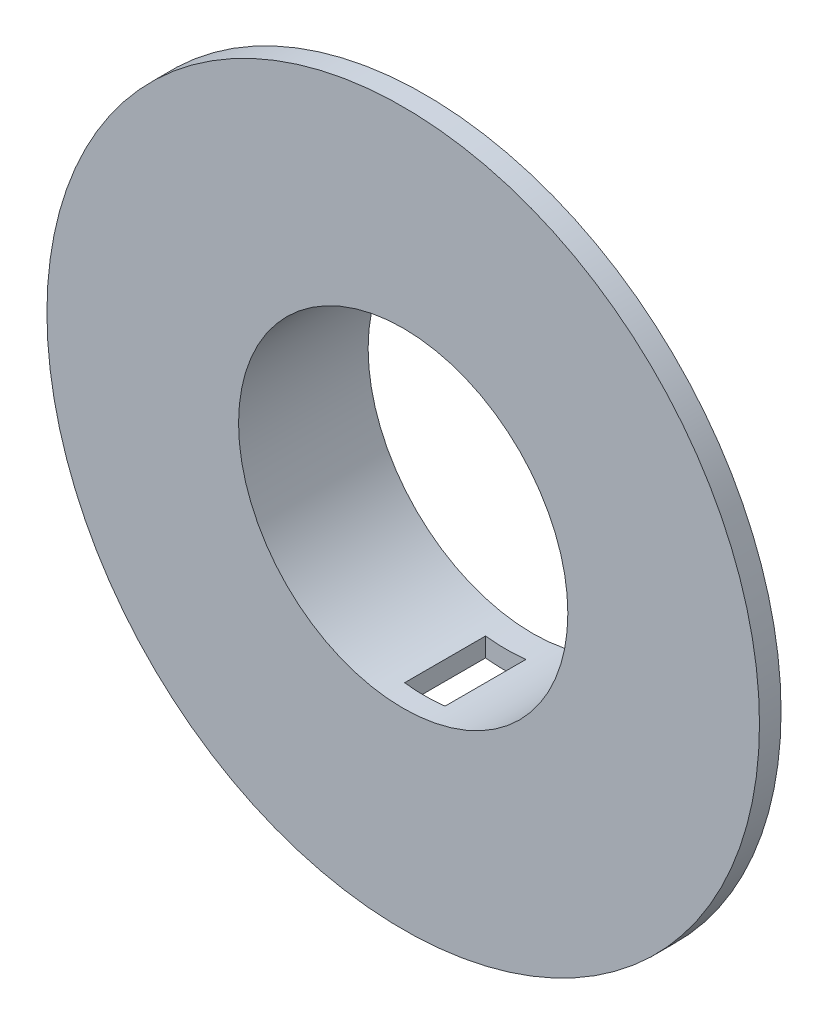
ISO-10303-21;
HEADER;
FILE_DESCRIPTION(('STEP AP214'),'2;1');
FILE_NAME('part.step','',(''),(''),'','','');
FILE_SCHEMA(('AUTOMOTIVE_DESIGN { 1 0 10303 214 1 1 1 1 }'));
ENDSEC;
DATA;
#1=APPLICATION_CONTEXT('core data for automotive mechanical design processes');
#2=APPLICATION_PROTOCOL_DEFINITION('international standard','automotive_design',2000,#1);
#3=PRODUCT_CONTEXT('',#1,'mechanical');
#4=PRODUCT('Part','Part','',(#3));
#5=PRODUCT_RELATED_PRODUCT_CATEGORY('part','',(#4));
#6=PRODUCT_DEFINITION_FORMATION('','',#4);
#7=PRODUCT_DEFINITION_CONTEXT('part definition',#1,'design');
#8=PRODUCT_DEFINITION('design','',#6,#7);
#9=PRODUCT_DEFINITION_SHAPE('','',#8);
#10=(LENGTH_UNIT() NAMED_UNIT(*) SI_UNIT(.MILLI.,.METRE.));
#11=(NAMED_UNIT(*) PLANE_ANGLE_UNIT() SI_UNIT($,.RADIAN.));
#12=(NAMED_UNIT(*) SI_UNIT($,.STERADIAN.) SOLID_ANGLE_UNIT());
#13=UNCERTAINTY_MEASURE_WITH_UNIT(LENGTH_MEASURE(1.E-05),#10,'distance_accuracy_value','');
#14=(GEOMETRIC_REPRESENTATION_CONTEXT(3) GLOBAL_UNCERTAINTY_ASSIGNED_CONTEXT((#13)) GLOBAL_UNIT_ASSIGNED_CONTEXT((#10,
#11,#12)) REPRESENTATION_CONTEXT('',''));
#15=CARTESIAN_POINT('',(0.,0.,0.));
#16=DIRECTION('',(0.,0.,1.));
#17=DIRECTION('',(1.,0.,0.));
#18=AXIS2_PLACEMENT_3D('',#15,#16,#17);
#19=CARTESIAN_POINT('',(0.,0.,4.));
#20=DIRECTION('',(0.,0.,-1.));
#21=DIRECTION('',(-1.,0.,0.));
#22=AXIS2_PLACEMENT_3D('',#19,#20,#21);
#23=CYLINDRICAL_SURFACE('',#22,66.);
#24=CARTESIAN_POINT('',(0.,0.,4.));
#25=DIRECTION('',(0.,0.,1.));
#26=DIRECTION('',(1.,0.,0.));
#27=AXIS2_PLACEMENT_3D('',#24,#25,#26);
#28=CIRCLE('',#27,66.);
#29=CARTESIAN_POINT('',(66.,0.,4.));
#30=VERTEX_POINT('',#29);
#31=EDGE_CURVE('E140',#30,#30,#28,.T.);
#32=ORIENTED_EDGE('',*,*,#31,.F.);
#33=EDGE_LOOP('',(#32));
#34=FACE_BOUND('',#33,.T.);
#35=CARTESIAN_POINT('',(0.,0.,0.));
#36=DIRECTION('',(0.,0.,1.));
#37=DIRECTION('',(1.,0.,0.));
#38=AXIS2_PLACEMENT_3D('',#35,#36,#37);
#39=CIRCLE('',#38,66.);
#40=CARTESIAN_POINT('',(66.,0.,0.));
#41=VERTEX_POINT('',#40);
#42=EDGE_CURVE('E146',#41,#41,#39,.T.);
#43=ORIENTED_EDGE('',*,*,#42,.T.);
#44=EDGE_LOOP('',(#43));
#45=FACE_BOUND('',#44,.T.);
#46=ADVANCED_FACE('F44',(#34,#45),#23,.T.);
#47=CARTESIAN_POINT('',(0.,0.,4.));
#48=DIRECTION('',(0.,0.,1.));
#49=DIRECTION('',(1.,0.,0.));
#50=AXIS2_PLACEMENT_3D('',#47,#48,#49);
#51=PLANE('',#50);
#52=CARTESIAN_POINT('',(0.,0.,4.));
#53=DIRECTION('',(0.,0.,1.));
#54=DIRECTION('',(1.,0.,0.));
#55=AXIS2_PLACEMENT_3D('',#52,#53,#54);
#56=CIRCLE('',#55,30.5);
#57=CARTESIAN_POINT('',(30.5,0.,4.));
#58=VERTEX_POINT('',#57);
#59=EDGE_CURVE('E143',#58,#58,#56,.T.);
#60=ORIENTED_EDGE('',*,*,#59,.F.);
#61=EDGE_LOOP('',(#60));
#62=FACE_BOUND('',#61,.T.);
#63=ORIENTED_EDGE('',*,*,#31,.T.);
#64=EDGE_LOOP('',(#63));
#65=FACE_BOUND('',#64,.T.);
#66=ADVANCED_FACE('F236',(#62,#65),#51,.T.);
#67=CARTESIAN_POINT('',(0.,0.,0.));
#68=DIRECTION('',(0.,0.,1.));
#69=DIRECTION('',(1.,0.,0.));
#70=AXIS2_PLACEMENT_3D('',#67,#68,#69);
#71=PLANE('',#70);
#72=CARTESIAN_POINT('',(0.,0.,0.));
#73=DIRECTION('',(0.,0.,-1.));
#74=DIRECTION('',(-1.,0.,0.));
#75=AXIS2_PLACEMENT_3D('',#72,#73,#74);
#76=CIRCLE('',#75,34.);
#77=CARTESIAN_POINT('',(-3.75,-33.7925657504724,0.));
#78=VERTEX_POINT('',#77);
#79=CARTESIAN_POINT('',(-3.75,33.7925657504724,0.));
#80=VERTEX_POINT('',#79);
#81=EDGE_CURVE('E137',#78,#80,#76,.T.);
#82=ORIENTED_EDGE('',*,*,#81,.F.);
#83=DIRECTION('',(0.,1.,0.));
#84=VECTOR('',#83,1.);
#85=CARTESIAN_POINT('',(-3.75,-66.,0.));
#86=LINE('',#85,#84);
#87=CARTESIAN_POINT('',(-3.75,-30.2685893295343,0.));
#88=VERTEX_POINT('',#87);
#89=EDGE_CURVE('E58',#78,#88,#86,.T.);
#90=ORIENTED_EDGE('',*,*,#89,.T.);
#91=CARTESIAN_POINT('',(0.,0.,0.));
#92=DIRECTION('',(0.,0.,1.));
#93=DIRECTION('',(1.,0.,0.));
#94=AXIS2_PLACEMENT_3D('',#91,#92,#93);
#95=CIRCLE('',#94,30.5);
#96=CARTESIAN_POINT('',(3.75,-30.2685893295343,0.));
#97=VERTEX_POINT('',#96);
#98=EDGE_CURVE('E130',#97,#88,#95,.F.);
#99=ORIENTED_EDGE('',*,*,#98,.F.);
#100=DIRECTION('',(0.,1.,0.));
#101=VECTOR('',#100,1.);
#102=CARTESIAN_POINT('',(3.75,-66.,0.));
#103=LINE('',#102,#101);
#104=CARTESIAN_POINT('',(3.75,-33.7925657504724,0.));
#105=VERTEX_POINT('',#104);
#106=EDGE_CURVE('E115',#105,#97,#103,.T.);
#107=ORIENTED_EDGE('',*,*,#106,.F.);
#108=CARTESIAN_POINT('',(3.75,33.7925657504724,0.));
#109=VERTEX_POINT('',#108);
#110=EDGE_CURVE('E125',#109,#105,#76,.T.);
#111=ORIENTED_EDGE('',*,*,#110,.F.);
#112=CARTESIAN_POINT('',(3.75,30.2685893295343,0.));
#113=VERTEX_POINT('',#112);
#114=EDGE_CURVE('E67',#113,#109,#103,.T.);
#115=ORIENTED_EDGE('',*,*,#114,.F.);
#116=CARTESIAN_POINT('',(-3.75,30.2685893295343,0.));
#117=VERTEX_POINT('',#116);
#118=EDGE_CURVE('E182',#117,#113,#95,.F.);
#119=ORIENTED_EDGE('',*,*,#118,.F.);
#120=EDGE_CURVE('E189',#117,#80,#86,.T.);
#121=ORIENTED_EDGE('',*,*,#120,.T.);
#122=EDGE_LOOP('',(#82,#90,#99,#107,#111,#115,#119,#121));
#123=FACE_BOUND('',#122,.T.);
#124=ORIENTED_EDGE('',*,*,#42,.F.);
#125=EDGE_LOOP('',(#124));
#126=FACE_BOUND('',#125,.T.);
#127=ADVANCED_FACE('F121',(#123,#126),#71,.F.);
#128=CARTESIAN_POINT('',(0.,0.,-26.));
#129=DIRECTION('',(0.,0.,1.));
#130=DIRECTION('',(1.,0.,0.));
#131=AXIS2_PLACEMENT_3D('',#128,#129,#130);
#132=CYLINDRICAL_SURFACE('',#131,30.5);
#133=ORIENTED_EDGE('',*,*,#98,.T.);
#134=DIRECTION('',(0.,0.,1.));
#135=VECTOR('',#134,1.);
#136=CARTESIAN_POINT('',(-3.75,-30.2685893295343,-26.));
#137=LINE('',#136,#135);
#138=CARTESIAN_POINT('',(-3.75,-30.2685893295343,-15.));
#139=VERTEX_POINT('',#138);
#140=EDGE_CURVE('E210',#88,#139,#137,.F.);
#141=ORIENTED_EDGE('',*,*,#140,.T.);
#142=CARTESIAN_POINT('',(0.,0.,-15.));
#143=DIRECTION('',(0.,0.,-1.));
#144=DIRECTION('',(-1.,0.,0.));
#145=AXIS2_PLACEMENT_3D('',#142,#143,#144);
#146=CIRCLE('',#145,30.5);
#147=CARTESIAN_POINT('',(3.75,-30.2685893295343,-15.));
#148=VERTEX_POINT('',#147);
#149=EDGE_CURVE('E203',#139,#148,#146,.F.);
#150=ORIENTED_EDGE('',*,*,#149,.T.);
#151=DIRECTION('',(0.,0.,1.));
#152=VECTOR('',#151,1.);
#153=CARTESIAN_POINT('',(3.75,-30.2685893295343,-26.));
#154=LINE('',#153,#152);
#155=EDGE_CURVE('E191',#148,#97,#154,.T.);
#156=ORIENTED_EDGE('',*,*,#155,.T.);
#157=EDGE_LOOP('',(#133,#141,#150,#156));
#158=FACE_BOUND('',#157,.T.);
#159=CARTESIAN_POINT('',(3.75,30.2685893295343,-15.));
#160=VERTEX_POINT('',#159);
#161=CARTESIAN_POINT('',(-3.75,30.2685893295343,-15.));
#162=VERTEX_POINT('',#161);
#163=EDGE_CURVE('E201',#160,#162,#146,.F.);
#164=ORIENTED_EDGE('',*,*,#163,.T.);
#165=DIRECTION('',(0.,0.,1.));
#166=VECTOR('',#165,1.);
#167=CARTESIAN_POINT('',(-3.75,30.2685893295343,-26.));
#168=LINE('',#167,#166);
#169=EDGE_CURVE('E176',#162,#117,#168,.T.);
#170=ORIENTED_EDGE('',*,*,#169,.T.);
#171=ORIENTED_EDGE('',*,*,#118,.T.);
#172=DIRECTION('',(0.,0.,1.));
#173=VECTOR('',#172,1.);
#174=CARTESIAN_POINT('',(3.75,30.2685893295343,-26.));
#175=LINE('',#174,#173);
#176=EDGE_CURVE('E197',#113,#160,#175,.F.);
#177=ORIENTED_EDGE('',*,*,#176,.T.);
#178=EDGE_LOOP('',(#164,#170,#171,#177));
#179=FACE_BOUND('',#178,.T.);
#180=ORIENTED_EDGE('',*,*,#59,.T.);
#181=EDGE_LOOP('',(#180));
#182=FACE_BOUND('',#181,.T.);
#183=CARTESIAN_POINT('',(0.,0.,-20.));
#184=DIRECTION('',(0.,0.,-1.));
#185=DIRECTION('',(-1.,0.,0.));
#186=AXIS2_PLACEMENT_3D('',#183,#184,#185);
#187=CIRCLE('',#186,30.5);
#188=CARTESIAN_POINT('',(-30.5,0.,-20.));
#189=VERTEX_POINT('',#188);
#190=EDGE_CURVE('E208',#189,#189,#187,.T.);
#191=ORIENTED_EDGE('',*,*,#190,.T.);
#192=EDGE_LOOP('',(#191));
#193=FACE_BOUND('',#192,.T.);
#194=ADVANCED_FACE('F233',(#158,#179,#182,#193),#132,.F.);
#195=CARTESIAN_POINT('',(0.,0.,-20.));
#196=DIRECTION('',(0.,0.,-1.));
#197=DIRECTION('',(-1.,0.,0.));
#198=AXIS2_PLACEMENT_3D('',#195,#196,#197);
#199=PLANE('',#198);
#200=ORIENTED_EDGE('',*,*,#190,.F.);
#201=EDGE_LOOP('',(#200));
#202=FACE_BOUND('',#201,.T.);
#203=CARTESIAN_POINT('',(0.,0.,-20.));
#204=DIRECTION('',(0.,0.,-1.));
#205=DIRECTION('',(-1.,0.,0.));
#206=AXIS2_PLACEMENT_3D('',#203,#204,#205);
#207=CIRCLE('',#206,34.);
#208=CARTESIAN_POINT('',(-34.,0.,-20.));
#209=VERTEX_POINT('',#208);
#210=EDGE_CURVE('E141',#209,#209,#207,.T.);
#211=ORIENTED_EDGE('',*,*,#210,.T.);
#212=EDGE_LOOP('',(#211));
#213=FACE_BOUND('',#212,.T.);
#214=ADVANCED_FACE('F218',(#202,#213),#199,.T.);
#215=CARTESIAN_POINT('',(0.,0.,-20.));
#216=DIRECTION('',(0.,0.,1.));
#217=DIRECTION('',(1.,0.,0.));
#218=AXIS2_PLACEMENT_3D('',#215,#216,#217);
#219=CYLINDRICAL_SURFACE('',#218,34.);
#220=ORIENTED_EDGE('',*,*,#210,.F.);
#221=EDGE_LOOP('',(#220));
#222=FACE_BOUND('',#221,.T.);
#223=ORIENTED_EDGE('',*,*,#81,.T.);
#224=DIRECTION('',(0.,0.,1.));
#225=VECTOR('',#224,1.);
#226=CARTESIAN_POINT('',(-3.75,33.7925657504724,-20.));
#227=LINE('',#226,#225);
#228=CARTESIAN_POINT('',(-3.75,33.7925657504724,-15.));
#229=VERTEX_POINT('',#228);
#230=EDGE_CURVE('E11',#80,#229,#227,.F.);
#231=ORIENTED_EDGE('',*,*,#230,.T.);
#232=CARTESIAN_POINT('',(0.,0.,-15.));
#233=DIRECTION('',(0.,0.,-1.));
#234=DIRECTION('',(-1.,0.,0.));
#235=AXIS2_PLACEMENT_3D('',#232,#233,#234);
#236=CIRCLE('',#235,34.);
#237=CARTESIAN_POINT('',(3.75,33.7925657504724,-15.));
#238=VERTEX_POINT('',#237);
#239=EDGE_CURVE('E52',#229,#238,#236,.T.);
#240=ORIENTED_EDGE('',*,*,#239,.T.);
#241=DIRECTION('',(0.,0.,1.));
#242=VECTOR('',#241,1.);
#243=CARTESIAN_POINT('',(3.75,33.7925657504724,-20.));
#244=LINE('',#243,#242);
#245=EDGE_CURVE('E135',#238,#109,#244,.T.);
#246=ORIENTED_EDGE('',*,*,#245,.T.);
#247=ORIENTED_EDGE('',*,*,#110,.T.);
#248=DIRECTION('',(0.,0.,1.));
#249=VECTOR('',#248,1.);
#250=CARTESIAN_POINT('',(3.75,-33.7925657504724,-20.));
#251=LINE('',#250,#249);
#252=CARTESIAN_POINT('',(3.75,-33.7925657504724,-15.));
#253=VERTEX_POINT('',#252);
#254=EDGE_CURVE('E107',#105,#253,#251,.F.);
#255=ORIENTED_EDGE('',*,*,#254,.T.);
#256=CARTESIAN_POINT('',(-3.75,-33.7925657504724,-15.));
#257=VERTEX_POINT('',#256);
#258=EDGE_CURVE('E122',#253,#257,#236,.T.);
#259=ORIENTED_EDGE('',*,*,#258,.T.);
#260=DIRECTION('',(0.,0.,1.));
#261=VECTOR('',#260,1.);
#262=CARTESIAN_POINT('',(-3.75,-33.7925657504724,-20.));
#263=LINE('',#262,#261);
#264=EDGE_CURVE('E159',#257,#78,#263,.T.);
#265=ORIENTED_EDGE('',*,*,#264,.T.);
#266=EDGE_LOOP('',(#223,#231,#240,#246,#247,#255,#259,#265));
#267=FACE_BOUND('',#266,.T.);
#268=ADVANCED_FACE('F134',(#222,#267),#219,.T.);
#269=CARTESIAN_POINT('',(3.75,-66.,-15.));
#270=DIRECTION('',(1.,0.,0.));
#271=DIRECTION('',(0.,0.,-1.));
#272=AXIS2_PLACEMENT_3D('',#269,#270,#271);
#273=PLANE('',#272);
#274=DIRECTION('',(0.,1.,0.));
#275=VECTOR('',#274,1.);
#276=CARTESIAN_POINT('',(3.75,-66.,-15.));
#277=LINE('',#276,#275);
#278=EDGE_CURVE('E114',#253,#148,#277,.T.);
#279=ORIENTED_EDGE('',*,*,#278,.F.);
#280=ORIENTED_EDGE('',*,*,#254,.F.);
#281=ORIENTED_EDGE('',*,*,#106,.T.);
#282=ORIENTED_EDGE('',*,*,#155,.F.);
#283=EDGE_LOOP('',(#279,#280,#281,#282));
#284=FACE_BOUND('',#283,.T.);
#285=ADVANCED_FACE('F111',(#284),#273,.F.);
#286=CARTESIAN_POINT('',(3.75,-66.,-15.));
#287=DIRECTION('',(0.,0.,-1.));
#288=DIRECTION('',(-1.,0.,0.));
#289=AXIS2_PLACEMENT_3D('',#286,#287,#288);
#290=PLANE('',#289);
#291=DIRECTION('',(0.,1.,0.));
#292=VECTOR('',#291,1.);
#293=CARTESIAN_POINT('',(-3.75,-66.,-15.));
#294=LINE('',#293,#292);
#295=EDGE_CURVE('E178',#257,#139,#294,.T.);
#296=ORIENTED_EDGE('',*,*,#295,.F.);
#297=ORIENTED_EDGE('',*,*,#258,.F.);
#298=ORIENTED_EDGE('',*,*,#278,.T.);
#299=ORIENTED_EDGE('',*,*,#149,.F.);
#300=EDGE_LOOP('',(#296,#297,#298,#299));
#301=FACE_BOUND('',#300,.T.);
#302=ADVANCED_FACE('F227',(#301),#290,.F.);
#303=CARTESIAN_POINT('',(-3.75,-66.,-15.));
#304=DIRECTION('',(-1.,0.,0.));
#305=DIRECTION('',(0.,0.,1.));
#306=AXIS2_PLACEMENT_3D('',#303,#304,#305);
#307=PLANE('',#306);
#308=ORIENTED_EDGE('',*,*,#89,.F.);
#309=ORIENTED_EDGE('',*,*,#264,.F.);
#310=ORIENTED_EDGE('',*,*,#295,.T.);
#311=ORIENTED_EDGE('',*,*,#140,.F.);
#312=EDGE_LOOP('',(#308,#309,#310,#311));
#313=FACE_BOUND('',#312,.T.);
#314=ADVANCED_FACE('F256',(#313),#307,.F.);
#315=EDGE_CURVE('E166',#162,#229,#294,.T.);
#316=ORIENTED_EDGE('',*,*,#315,.T.);
#317=ORIENTED_EDGE('',*,*,#230,.F.);
#318=ORIENTED_EDGE('',*,*,#120,.F.);
#319=ORIENTED_EDGE('',*,*,#169,.F.);
#320=EDGE_LOOP('',(#316,#317,#318,#319));
#321=FACE_BOUND('',#320,.T.);
#322=ADVANCED_FACE('F175',(#321),#307,.F.);
#323=EDGE_CURVE('E126',#160,#238,#277,.T.);
#324=ORIENTED_EDGE('',*,*,#323,.T.);
#325=ORIENTED_EDGE('',*,*,#239,.F.);
#326=ORIENTED_EDGE('',*,*,#315,.F.);
#327=ORIENTED_EDGE('',*,*,#163,.F.);
#328=EDGE_LOOP('',(#324,#325,#326,#327));
#329=FACE_BOUND('',#328,.T.);
#330=ADVANCED_FACE('F170',(#329),#290,.F.);
#331=ORIENTED_EDGE('',*,*,#114,.T.);
#332=ORIENTED_EDGE('',*,*,#245,.F.);
#333=ORIENTED_EDGE('',*,*,#323,.F.);
#334=ORIENTED_EDGE('',*,*,#176,.F.);
#335=EDGE_LOOP('',(#331,#332,#333,#334));
#336=FACE_BOUND('',#335,.T.);
#337=ADVANCED_FACE('F230',(#336),#273,.F.);
#338=CLOSED_SHELL('',(#46,#66,#127,#194,#214,#268,#285,#302,#314,#322,#330,#337));
#339=MANIFOLD_SOLID_BREP('B2',#338);
#340=ADVANCED_BREP_SHAPE_REPRESENTATION('',(#18,#339),#14);
#341=SHAPE_DEFINITION_REPRESENTATION(#9,#340);
ENDSEC;
END-ISO-10303-21;
